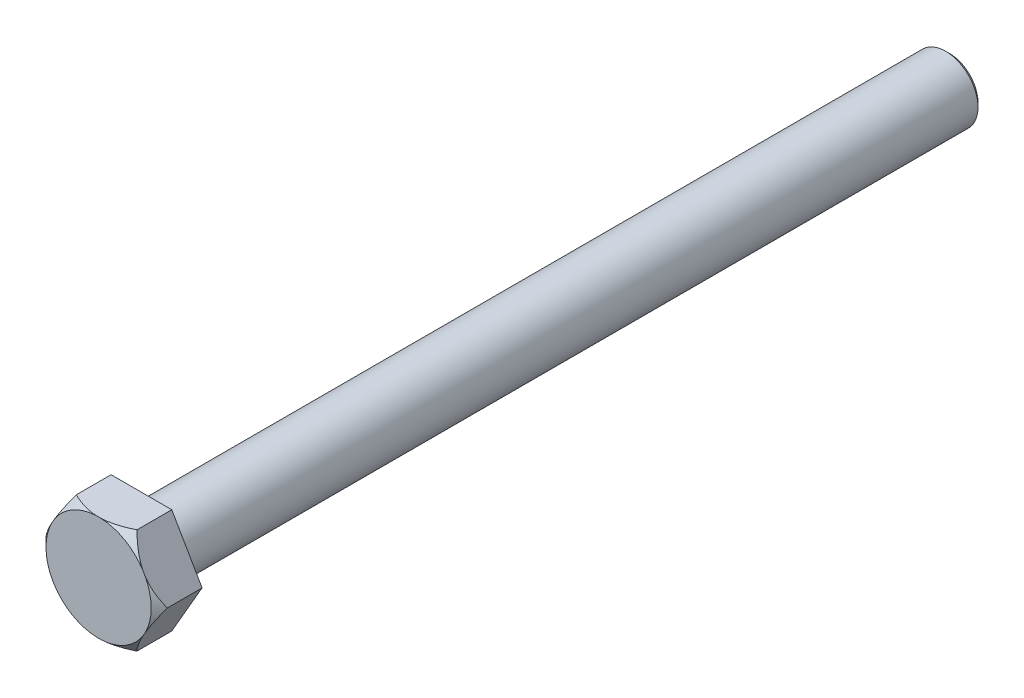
ISO-10303-21;
HEADER;
FILE_DESCRIPTION(('STEP AP214'),'2;1');
FILE_NAME('part.step','',(''),(''),'','','');
FILE_SCHEMA(('AUTOMOTIVE_DESIGN { 1 0 10303 214 1 1 1 1 }'));
ENDSEC;
DATA;
#1=APPLICATION_CONTEXT('core data for automotive mechanical design processes');
#2=APPLICATION_PROTOCOL_DEFINITION('international standard','automotive_design',2000,#1);
#3=PRODUCT_CONTEXT('',#1,'mechanical');
#4=PRODUCT('Part','Part','',(#3));
#5=PRODUCT_RELATED_PRODUCT_CATEGORY('part','',(#4));
#6=PRODUCT_DEFINITION_FORMATION('','',#4);
#7=PRODUCT_DEFINITION_CONTEXT('part definition',#1,'design');
#8=PRODUCT_DEFINITION('design','',#6,#7);
#9=PRODUCT_DEFINITION_SHAPE('','',#8);
#10=(LENGTH_UNIT() NAMED_UNIT(*) SI_UNIT(.MILLI.,.METRE.));
#11=(NAMED_UNIT(*) PLANE_ANGLE_UNIT() SI_UNIT($,.RADIAN.));
#12=(NAMED_UNIT(*) SI_UNIT($,.STERADIAN.) SOLID_ANGLE_UNIT());
#13=UNCERTAINTY_MEASURE_WITH_UNIT(LENGTH_MEASURE(1.E-05),#10,'distance_accuracy_value','');
#14=(GEOMETRIC_REPRESENTATION_CONTEXT(3) GLOBAL_UNCERTAINTY_ASSIGNED_CONTEXT((#13)) GLOBAL_UNIT_ASSIGNED_CONTEXT((#10,
#11,#12)) REPRESENTATION_CONTEXT('',''));
#15=CARTESIAN_POINT('',(0.,0.,0.));
#16=DIRECTION('',(0.,0.,1.));
#17=DIRECTION('',(1.,0.,0.));
#18=AXIS2_PLACEMENT_3D('',#15,#16,#17);
#19=CARTESIAN_POINT('',(0.,-4.,0.));
#20=DIRECTION('',(0.,0.,1.));
#21=DIRECTION('',(1.,0.,0.));
#22=AXIS2_PLACEMENT_3D('',#19,#20,#21);
#23=PLANE('',#22);
#24=CARTESIAN_POINT('',(0.,0.,0.));
#25=DIRECTION('',(0.,0.,1.));
#26=DIRECTION('',(1.,0.,0.));
#27=AXIS2_PLACEMENT_3D('',#24,#25,#26);
#28=CIRCLE('',#27,4.);
#29=CARTESIAN_POINT('',(4.,0.,0.));
#30=VERTEX_POINT('',#29);
#31=EDGE_CURVE('E11',#30,#30,#28,.T.);
#32=ORIENTED_EDGE('',*,*,#31,.T.);
#33=EDGE_LOOP('',(#32));
#34=FACE_BOUND('',#33,.T.);
#35=ADVANCED_FACE('F38',(#34),#23,.T.);
#36=CARTESIAN_POINT('',(0.,0.,0.));
#37=DIRECTION('',(0.,0.,1.));
#38=DIRECTION('',(1.,0.,0.));
#39=AXIS2_PLACEMENT_3D('',#36,#37,#38);
#40=CYLINDRICAL_SURFACE('',#39,4.);
#41=CARTESIAN_POINT('',(0.,0.,-99.5));
#42=DIRECTION('',(0.,0.,1.));
#43=DIRECTION('',(1.,0.,0.));
#44=AXIS2_PLACEMENT_3D('',#41,#42,#43);
#45=CIRCLE('',#44,4.);
#46=CARTESIAN_POINT('',(4.,0.,-99.5));
#47=VERTEX_POINT('',#46);
#48=EDGE_CURVE('E44',#47,#47,#45,.T.);
#49=ORIENTED_EDGE('',*,*,#48,.T.);
#50=EDGE_LOOP('',(#49));
#51=FACE_BOUND('',#50,.T.);
#52=ORIENTED_EDGE('',*,*,#31,.F.);
#53=EDGE_LOOP('',(#52));
#54=FACE_BOUND('',#53,.T.);
#55=ADVANCED_FACE('F64',(#51,#54),#40,.T.);
#56=CARTESIAN_POINT('',(0.,0.,-99.5));
#57=DIRECTION('',(0.,0.,1.));
#58=DIRECTION('',(1.,0.,0.));
#59=AXIS2_PLACEMENT_3D('',#56,#57,#58);
#60=CONICAL_SURFACE('',#59,4.,0.785398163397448);
#61=CARTESIAN_POINT('',(0.,0.,-100.));
#62=DIRECTION('',(0.,0.,1.));
#63=DIRECTION('',(1.,0.,0.));
#64=AXIS2_PLACEMENT_3D('',#61,#62,#63);
#65=CIRCLE('',#64,3.5);
#66=CARTESIAN_POINT('',(3.5,0.,-100.));
#67=VERTEX_POINT('',#66);
#68=EDGE_CURVE('E48',#67,#67,#65,.T.);
#69=ORIENTED_EDGE('',*,*,#68,.T.);
#70=EDGE_LOOP('',(#69));
#71=FACE_BOUND('',#70,.T.);
#72=ORIENTED_EDGE('',*,*,#48,.F.);
#73=EDGE_LOOP('',(#72));
#74=FACE_BOUND('',#73,.T.);
#75=ADVANCED_FACE('F55',(#71,#74),#60,.T.);
#76=CARTESIAN_POINT('',(0.,-3.5,-100.));
#77=DIRECTION('',(0.,0.,-1.));
#78=DIRECTION('',(-1.,0.,0.));
#79=AXIS2_PLACEMENT_3D('',#76,#77,#78);
#80=PLANE('',#79);
#81=ORIENTED_EDGE('',*,*,#68,.F.);
#82=EDGE_LOOP('',(#81));
#83=FACE_BOUND('',#82,.T.);
#84=ADVANCED_FACE('F58',(#83),#80,.T.);
#85=CLOSED_SHELL('',(#35,#55,#75,#84));
#86=MANIFOLD_SOLID_BREP('B2',#85);
#87=CARTESIAN_POINT('',(3.75277674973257,-6.5,5.3));
#88=DIRECTION('',(-0.866025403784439,0.5,0.));
#89=DIRECTION('',(-0.5,-0.866025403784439,0.));
#90=AXIS2_PLACEMENT_3D('',#87,#88,#89);
#91=PLANE('',#90);
#92=DIRECTION('',(0.,0.,-1.));
#93=VECTOR('',#92,1.);
#94=CARTESIAN_POINT('',(7.50555349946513,0.,5.3));
#95=LINE('',#94,#93);
#96=CARTESIAN_POINT('',(7.50555349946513,0.,4.3));
#97=VERTEX_POINT('',#96);
#98=CARTESIAN_POINT('',(7.50555349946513,0.,0.));
#99=VERTEX_POINT('',#98);
#100=EDGE_CURVE('E240',#97,#99,#95,.T.);
#101=ORIENTED_EDGE('',*,*,#100,.F.);
#102=CARTESIAN_POINT('',(10.1286443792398,4.54332667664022,0.704596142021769));
#103=CARTESIAN_POINT('',(10.039761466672,4.38937695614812,0.848684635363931));
#104=CARTESIAN_POINT('',(9.95052655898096,4.23481756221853,0.991912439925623));
#105=CARTESIAN_POINT('',(9.77123095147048,3.92426846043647,1.27631743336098));
#106=CARTESIAN_POINT('',(9.68117017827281,3.76827862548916,1.41749443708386));
#107=CARTESIAN_POINT('',(9.49990390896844,3.45431623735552,1.69777201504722));
#108=CARTESIAN_POINT('',(9.40869621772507,3.29633988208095,1.83686692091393));
#109=CARTESIAN_POINT('',(9.2252068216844,2.97852692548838,2.11218789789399));
#110=CARTESIAN_POINT('',(9.13292514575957,2.81869037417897,2.24841404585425));
#111=CARTESIAN_POINT('',(8.94456358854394,2.49243858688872,2.52115169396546));
#112=CARTESIAN_POINT('',(8.84844908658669,2.32596338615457,2.65756778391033));
#113=CARTESIAN_POINT('',(8.65470525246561,1.99038922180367,2.92602381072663));
#114=CARTESIAN_POINT('',(8.5570759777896,1.82129035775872,3.0580639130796));
#115=CARTESIAN_POINT('',(8.36013893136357,1.48018538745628,3.31668899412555));
#116=CARTESIAN_POINT('',(8.26083264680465,1.30818185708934,3.44327848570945));
#117=CARTESIAN_POINT('',(8.0601982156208,0.960672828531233,3.68985078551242));
#118=CARTESIAN_POINT('',(7.95887032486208,0.78516777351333,3.80983442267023));
#119=CARTESIAN_POINT('',(7.75111491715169,0.425324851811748,4.04472132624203));
#120=CARTESIAN_POINT('',(7.64462356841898,0.24087642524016,4.15940026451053));
#121=CARTESIAN_POINT('',(7.42883796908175,-0.132875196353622,4.37785828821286));
#122=CARTESIAN_POINT('',(7.31954332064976,-0.3221790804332,4.48163581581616));
#123=CARTESIAN_POINT('',(7.09850568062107,-0.705027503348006,4.67487713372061));
#124=CARTESIAN_POINT('',(6.98677906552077,-0.898543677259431,4.7644150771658));
#125=CARTESIAN_POINT('',(6.76025349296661,-1.29089747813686,4.92639894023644));
#126=CARTESIAN_POINT('',(6.64545547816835,-1.48973347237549,4.99885003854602));
#127=CARTESIAN_POINT('',(6.43587432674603,-1.85273867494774,5.11072478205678));
#128=CARTESIAN_POINT('',(6.34158660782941,-2.01604979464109,5.15384004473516));
#129=CARTESIAN_POINT('',(6.15157362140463,-2.34516194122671,5.22476075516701));
#130=CARTESIAN_POINT('',(6.0558485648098,-2.51096260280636,5.25256842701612));
#131=CARTESIAN_POINT('',(5.8637126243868,-2.84375181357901,5.29144611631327));
#132=CARTESIAN_POINT('',(5.76730326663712,-3.01073771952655,5.30254587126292));
#133=CARTESIAN_POINT('',(5.5743709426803,-3.34490630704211,5.30749252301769));
#134=CARTESIAN_POINT('',(5.47784797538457,-3.51208899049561,5.30133925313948));
#135=CARTESIAN_POINT('',(5.28569658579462,-3.84490496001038,5.27215863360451));
#136=CARTESIAN_POINT('',(5.19006652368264,-4.01054108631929,5.24917378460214));
#137=CARTESIAN_POINT('',(5.00008490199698,-4.33959890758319,5.18756324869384));
#138=CARTESIAN_POINT('',(4.90573344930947,-4.50302041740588,5.14893626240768));
#139=CARTESIAN_POINT('',(4.71846263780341,-4.82738297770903,5.05763503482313));
#140=CARTESIAN_POINT('',(4.6255484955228,-4.98831499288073,5.00491850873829));
#141=CARTESIAN_POINT('',(4.44167070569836,-5.30680066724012,4.88744691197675));
#142=CARTESIAN_POINT('',(4.35070696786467,-5.46435448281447,4.82269239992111));
#143=CARTESIAN_POINT('',(4.13900239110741,-5.83103756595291,4.65838995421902));
#144=CARTESIAN_POINT('',(4.01908237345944,-6.03874512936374,4.55462806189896));
#145=CARTESIAN_POINT('',(3.78262258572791,-6.4483054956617,4.33258564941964));
#146=CARTESIAN_POINT('',(3.66608473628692,-6.65015497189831,4.21429707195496));
#147=CARTESIAN_POINT('',(3.43582542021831,-7.0489758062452,3.96621331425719));
#148=CARTESIAN_POINT('',(3.3221102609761,-7.2459362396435,3.83639489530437));
#149=CARTESIAN_POINT('',(3.09735084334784,-7.63523097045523,3.56796602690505));
#150=CARTESIAN_POINT('',(2.98630610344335,-7.82756610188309,3.4293571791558));
#151=CARTESIAN_POINT('',(2.76596059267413,-8.20921572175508,3.14452754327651));
#152=CARTESIAN_POINT('',(2.65667036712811,-8.39851194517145,2.99827427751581));
#153=CARTESIAN_POINT('',(2.44001623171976,-8.77376791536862,2.70017211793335));
#154=CARTESIAN_POINT('',(2.33265239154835,-8.95972754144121,2.54832302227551));
#155=CARTESIAN_POINT('',(2.11967159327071,-9.32862110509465,2.24027391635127));
#156=CARTESIAN_POINT('',(2.01405293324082,-9.51155799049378,2.08407859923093));
#157=CARTESIAN_POINT('',(1.80420589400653,-9.87502372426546,1.76801397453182));
#158=CARTESIAN_POINT('',(1.69997748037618,-10.0555526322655,1.60814475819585));
#159=CARTESIAN_POINT('',(1.51776278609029,-10.3711577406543,1.32438976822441));
#160=CARTESIAN_POINT('',(1.43952456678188,-10.5066703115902,1.20114938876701));
#161=CARTESIAN_POINT('',(1.28399947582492,-10.7760476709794,0.953684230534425));
#162=CARTESIAN_POINT('',(1.20670993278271,-10.9099170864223,0.829466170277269));
#163=CARTESIAN_POINT('',(1.12968586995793,-11.0433266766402,0.704596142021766));
#164=B_SPLINE_CURVE_WITH_KNOTS('',3,(#102,#103,#104,#105,#106,#107,#108,#109,#110,#111,#112,
#113,#114,#115,#116,#117,#118,#119,#120,#121,#122,#123,#124,#125,#126,#127,#128,#129,#130,#131,
#132,#133,#134,#135,#136,#137,#138,#139,#140,#141,#142,#143,#144,#145,#146,#147,#148,#149,#150,
#151,#152,#153,#154,#155,#156,#157,#158,#159,#160,#161,#162,#163),.UNSPECIFIED.,.F.,.F.,(4,2,2,
2,2,2,2,2,2,2,2,2,2,2,2,2,2,2,2,2,2,2,2,2,2,2,2,2,2,2,4),(0.,0.686488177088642,1.3730379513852,
2.06120340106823,2.749350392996,3.4564439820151,4.16351080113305,4.8699804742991,
5.57636129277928,6.30179544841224,7.02733312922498,7.74895922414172,8.47036632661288,
9.05013970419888,9.62982882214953,10.2084849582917,10.7871466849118,11.3643522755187,
11.941605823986,12.52061163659,13.0995905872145,13.8829026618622,14.6666511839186,
15.4520168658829,16.2372398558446,17.0261239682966,17.8150365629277,18.6031280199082,
19.3911999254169,19.9887336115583,20.5836377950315),.UNSPECIFIED.);
#165=CARTESIAN_POINT('',(5.76353991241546,-3.01725604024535,5.3));
#166=VERTEX_POINT('',#165);
#167=EDGE_CURVE('E218',#97,#166,#164,.T.);
#168=ORIENTED_EDGE('',*,*,#167,.T.);
#169=DIRECTION('',(0.5,0.866025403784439,0.));
#170=VECTOR('',#169,1.);
#171=CARTESIAN_POINT('',(3.75277674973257,-6.5,5.3));
#172=LINE('',#171,#170);
#173=CARTESIAN_POINT('',(5.49479033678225,-3.48274395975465,5.3));
#174=VERTEX_POINT('',#173);
#175=EDGE_CURVE('E232',#174,#166,#172,.T.);
#176=ORIENTED_EDGE('',*,*,#175,.F.);
#177=CARTESIAN_POINT('',(3.75277674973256,-6.5,4.3));
#178=VERTEX_POINT('',#177);
#179=EDGE_CURVE('E305',#174,#178,#164,.T.);
#180=ORIENTED_EDGE('',*,*,#179,.T.);
#181=DIRECTION('',(0.,0.,-1.));
#182=VECTOR('',#181,1.);
#183=CARTESIAN_POINT('',(3.75277674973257,-6.5,5.3));
#184=LINE('',#183,#182);
#185=CARTESIAN_POINT('',(3.75277674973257,-6.5,0.));
#186=VERTEX_POINT('',#185);
#187=EDGE_CURVE('E213',#178,#186,#184,.T.);
#188=ORIENTED_EDGE('',*,*,#187,.T.);
#189=DIRECTION('',(0.5,0.866025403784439,0.));
#190=VECTOR('',#189,1.);
#191=CARTESIAN_POINT('',(3.75277674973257,-6.5,0.));
#192=LINE('',#191,#190);
#193=EDGE_CURVE('E214',#186,#99,#192,.T.);
#194=ORIENTED_EDGE('',*,*,#193,.T.);
#195=EDGE_LOOP('',(#101,#168,#176,#180,#188,#194));
#196=FACE_BOUND('',#195,.T.);
#197=ADVANCED_FACE('F93',(#196),#91,.F.);
#198=CARTESIAN_POINT('',(7.50555349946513,0.,5.3));
#199=DIRECTION('',(-0.866025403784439,-0.5,0.));
#200=DIRECTION('',(0.5,-0.866025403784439,0.));
#201=AXIS2_PLACEMENT_3D('',#198,#199,#200);
#202=PLANE('',#201);
#203=DIRECTION('',(0.,0.,-1.));
#204=VECTOR('',#203,1.);
#205=CARTESIAN_POINT('',(3.75277674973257,6.5,5.3));
#206=LINE('',#205,#204);
#207=CARTESIAN_POINT('',(3.75277674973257,6.5,4.3));
#208=VERTEX_POINT('',#207);
#209=CARTESIAN_POINT('',(3.75277674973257,6.5,0.));
#210=VERTEX_POINT('',#209);
#211=EDGE_CURVE('E239',#208,#210,#206,.T.);
#212=ORIENTED_EDGE('',*,*,#211,.F.);
#213=CARTESIAN_POINT('',(1.12968586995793,11.0433266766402,0.704596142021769));
#214=CARTESIAN_POINT('',(1.21856878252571,10.8893769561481,0.848684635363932));
#215=CARTESIAN_POINT('',(1.30780369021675,10.7348175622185,0.991912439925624));
#216=CARTESIAN_POINT('',(1.48709929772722,10.4242684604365,1.27631743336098));
#217=CARTESIAN_POINT('',(1.57716007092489,10.2682786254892,1.41749443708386));
#218=CARTESIAN_POINT('',(1.75842634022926,9.95431623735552,1.69777201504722));
#219=CARTESIAN_POINT('',(1.84963403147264,9.79633988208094,1.83686692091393));
#220=CARTESIAN_POINT('',(2.0331234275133,9.47852692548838,2.11218789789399));
#221=CARTESIAN_POINT('',(2.12540510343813,9.31869037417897,2.24841404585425));
#222=CARTESIAN_POINT('',(2.31376666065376,8.99243858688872,2.52115169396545));
#223=CARTESIAN_POINT('',(2.40988116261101,8.82596338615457,2.65756778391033));
#224=CARTESIAN_POINT('',(2.60362499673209,8.49038922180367,2.92602381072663));
#225=CARTESIAN_POINT('',(2.7012542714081,8.32129035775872,3.05806391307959));
#226=CARTESIAN_POINT('',(2.89819131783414,7.98018538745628,3.31668899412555));
#227=CARTESIAN_POINT('',(2.99749760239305,7.80818185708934,3.44327848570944));
#228=CARTESIAN_POINT('',(3.1981320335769,7.46067282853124,3.68985078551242));
#229=CARTESIAN_POINT('',(3.29945992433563,7.28516777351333,3.80983442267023));
#230=CARTESIAN_POINT('',(3.50721533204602,6.92532485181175,4.04472132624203));
#231=CARTESIAN_POINT('',(3.61370668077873,6.74087642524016,4.15940026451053));
#232=CARTESIAN_POINT('',(3.82949228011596,6.36712480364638,4.37785828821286));
#233=CARTESIAN_POINT('',(3.93878692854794,6.1778209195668,4.48163581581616));
#234=CARTESIAN_POINT('',(4.15982456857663,5.794972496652,4.67487713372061));
#235=CARTESIAN_POINT('',(4.27155118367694,5.60145632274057,4.7644150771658));
#236=CARTESIAN_POINT('',(4.49807675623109,5.20910252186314,4.92639894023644));
#237=CARTESIAN_POINT('',(4.61287477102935,5.01026652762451,4.99885003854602));
#238=CARTESIAN_POINT('',(4.82245592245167,4.64726132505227,5.11072478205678));
#239=CARTESIAN_POINT('',(4.91674364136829,4.48395020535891,5.15384004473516));
#240=CARTESIAN_POINT('',(5.10675662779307,4.15483805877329,5.22476075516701));
#241=CARTESIAN_POINT('',(5.20248168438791,3.98903739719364,5.25256842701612));
#242=CARTESIAN_POINT('',(5.3946176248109,3.65624818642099,5.29144611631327));
#243=CARTESIAN_POINT('',(5.49102698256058,3.48926228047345,5.30254587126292));
#244=CARTESIAN_POINT('',(5.6839593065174,3.15509369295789,5.30749252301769));
#245=CARTESIAN_POINT('',(5.78048227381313,2.98791100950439,5.30133925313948));
#246=CARTESIAN_POINT('',(5.97263366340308,2.65509503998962,5.27215863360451));
#247=CARTESIAN_POINT('',(6.06826372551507,2.48945891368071,5.24917378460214));
#248=CARTESIAN_POINT('',(6.25824534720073,2.16040109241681,5.18756324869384));
#249=CARTESIAN_POINT('',(6.35259679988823,1.99697958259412,5.14893626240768));
#250=CARTESIAN_POINT('',(6.5398676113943,1.67261702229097,5.05763503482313));
#251=CARTESIAN_POINT('',(6.6327817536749,1.51168500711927,5.00491850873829));
#252=CARTESIAN_POINT('',(6.81665954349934,1.19319933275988,4.88744691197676));
#253=CARTESIAN_POINT('',(6.90762328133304,1.03564551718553,4.82269239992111));
#254=CARTESIAN_POINT('',(7.1193278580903,0.668962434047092,4.65838995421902));
#255=CARTESIAN_POINT('',(7.23924787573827,0.461254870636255,4.55462806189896));
#256=CARTESIAN_POINT('',(7.4757076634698,0.0516945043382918,4.33258564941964));
#257=CARTESIAN_POINT('',(7.59224551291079,-0.150154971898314,4.21429707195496));
#258=CARTESIAN_POINT('',(7.82250482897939,-0.548975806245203,3.96621331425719));
#259=CARTESIAN_POINT('',(7.93621998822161,-0.7459362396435,3.83639489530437));
#260=CARTESIAN_POINT('',(8.16097940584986,-1.13523097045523,3.56796602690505));
#261=CARTESIAN_POINT('',(8.27202414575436,-1.32756610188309,3.4293571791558));
#262=CARTESIAN_POINT('',(8.49236965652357,-1.70921572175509,3.14452754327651));
#263=CARTESIAN_POINT('',(8.6016598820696,-1.89851194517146,2.99827427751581));
#264=CARTESIAN_POINT('',(8.81831401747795,-2.27376791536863,2.70017211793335));
#265=CARTESIAN_POINT('',(8.92567785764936,-2.45972754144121,2.5483230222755));
#266=CARTESIAN_POINT('',(9.138658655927,-2.82862110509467,2.24027391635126));
#267=CARTESIAN_POINT('',(9.24427731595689,-3.01155799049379,2.08407859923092));
#268=CARTESIAN_POINT('',(9.45412435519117,-3.37502372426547,1.76801397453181));
#269=CARTESIAN_POINT('',(9.55835276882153,-3.55555263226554,1.60814475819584));
#270=CARTESIAN_POINT('',(9.74056746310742,-3.87115774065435,1.3243897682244));
#271=CARTESIAN_POINT('',(9.81880568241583,-4.00667031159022,1.20114938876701));
#272=CARTESIAN_POINT('',(9.97433077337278,-4.27604767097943,0.953684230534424));
#273=CARTESIAN_POINT('',(10.051620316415,-4.40991708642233,0.829466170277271));
#274=CARTESIAN_POINT('',(10.1286443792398,-4.54332667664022,0.704596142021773));
#275=B_SPLINE_CURVE_WITH_KNOTS('',3,(#213,#214,#215,#216,#217,#218,#219,#220,#221,#222,#223,
#224,#225,#226,#227,#228,#229,#230,#231,#232,#233,#234,#235,#236,#237,#238,#239,#240,#241,#242,
#243,#244,#245,#246,#247,#248,#249,#250,#251,#252,#253,#254,#255,#256,#257,#258,#259,#260,#261,
#262,#263,#264,#265,#266,#267,#268,#269,#270,#271,#272,#273,#274),.UNSPECIFIED.,.F.,.F.,(4,2,2,
2,2,2,2,2,2,2,2,2,2,2,2,2,2,2,2,2,2,2,2,2,2,2,2,2,2,2,4),(0.,0.686488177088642,1.37303795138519,
2.06120340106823,2.749350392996,3.4564439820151,4.16351080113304,4.86998047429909,
5.57636129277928,6.30179544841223,7.02733312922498,7.74895922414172,8.47036632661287,
9.05013970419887,9.62982882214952,10.2084849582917,10.7871466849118,11.3643522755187,
11.941605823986,12.52061163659,13.0995905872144,13.8829026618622,14.6666511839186,
15.4520168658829,16.2372398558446,17.0261239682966,17.8150365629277,18.6031280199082,
19.391199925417,19.9887336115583,20.5836377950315),.UNSPECIFIED.);
#276=CARTESIAN_POINT('',(5.49479033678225,3.48274395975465,5.3));
#277=VERTEX_POINT('',#276);
#278=EDGE_CURVE('E268',#208,#277,#275,.T.);
#279=ORIENTED_EDGE('',*,*,#278,.T.);
#280=DIRECTION('',(-0.5,0.866025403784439,0.));
#281=VECTOR('',#280,1.);
#282=CARTESIAN_POINT('',(7.50555349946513,0.,5.3));
#283=LINE('',#282,#281);
#284=CARTESIAN_POINT('',(5.76353991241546,3.01725604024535,5.3));
#285=VERTEX_POINT('',#284);
#286=EDGE_CURVE('E207',#285,#277,#283,.T.);
#287=ORIENTED_EDGE('',*,*,#286,.F.);
#288=EDGE_CURVE('E273',#285,#97,#275,.T.);
#289=ORIENTED_EDGE('',*,*,#288,.T.);
#290=ORIENTED_EDGE('',*,*,#100,.T.);
#291=DIRECTION('',(-0.5,0.866025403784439,0.));
#292=VECTOR('',#291,1.);
#293=CARTESIAN_POINT('',(7.50555349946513,0.,0.));
#294=LINE('',#293,#292);
#295=EDGE_CURVE('E217',#99,#210,#294,.T.);
#296=ORIENTED_EDGE('',*,*,#295,.T.);
#297=EDGE_LOOP('',(#212,#279,#287,#289,#290,#296));
#298=FACE_BOUND('',#297,.T.);
#299=ADVANCED_FACE('F278',(#298),#202,.F.);
#300=CARTESIAN_POINT('',(3.75277674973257,6.5,5.3));
#301=DIRECTION('',(0.,-1.,0.));
#302=DIRECTION('',(1.,0.,0.));
#303=AXIS2_PLACEMENT_3D('',#300,#301,#302);
#304=PLANE('',#303);
#305=DIRECTION('',(0.,0.,-1.));
#306=VECTOR('',#305,1.);
#307=CARTESIAN_POINT('',(-3.75277674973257,6.5,5.3));
#308=LINE('',#307,#306);
#309=CARTESIAN_POINT('',(-3.75277674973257,6.5,4.3));
#310=VERTEX_POINT('',#309);
#311=CARTESIAN_POINT('',(-3.75277674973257,6.5,0.));
#312=VERTEX_POINT('',#311);
#313=EDGE_CURVE('E237',#310,#312,#308,.T.);
#314=ORIENTED_EDGE('',*,*,#313,.F.);
#315=CARTESIAN_POINT('',(-8.29610342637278,6.5,1.26632525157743));
#316=CARTESIAN_POINT('',(-8.11036530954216,6.5,1.41250581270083));
#317=CARTESIAN_POINT('',(-7.92373684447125,6.5,1.55756954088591));
#318=CARTESIAN_POINT('',(-7.54835509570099,6.5,1.84498409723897));
#319=CARTESIAN_POINT('',(-7.35960146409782,6.5,1.98733447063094));
#320=CARTESIAN_POINT('',(-6.97873252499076,6.5,2.2695011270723));
#321=CARTESIAN_POINT('',(-6.7866050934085,6.5,2.40930108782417));
#322=CARTESIAN_POINT('',(-6.39953728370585,6.5,2.68493925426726));
#323=CARTESIAN_POINT('',(-6.20459704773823,6.5,2.82077765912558));
#324=CARTESIAN_POINT('',(-5.80175036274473,6.5,3.09421885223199));
#325=CARTESIAN_POINT('',(-5.59367836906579,6.5,3.231578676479));
#326=CARTESIAN_POINT('',(-5.17329124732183,6.5,3.49972871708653));
#327=CARTESIAN_POINT('',(-4.96097565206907,6.5,3.63051820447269));
#328=CARTESIAN_POINT('',(-4.53185755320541,6.5,3.88357409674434));
#329=CARTESIAN_POINT('',(-4.31506466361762,6.5,4.00585671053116));
#330=CARTESIAN_POINT('',(-3.87593140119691,6.5,4.23995118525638));
#331=CARTESIAN_POINT('',(-3.65359273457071,6.5,4.35176621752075));
#332=CARTESIAN_POINT('',(-3.22593082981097,6.5,4.55126761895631));
#333=CARTESIAN_POINT('',(-3.02121813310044,6.5,4.64025315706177));
#334=CARTESIAN_POINT('',(-2.60646306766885,6.5,4.80502186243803));
#335=CARTESIAN_POINT('',(-2.39642019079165,6.5,4.88080376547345));
#336=CARTESIAN_POINT('',(-1.97356357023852,6.5,5.01546630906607));
#337=CARTESIAN_POINT('',(-1.76080909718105,6.5,5.07453054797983));
#338=CARTESIAN_POINT('',(-1.33093571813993,6.5,5.17398366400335));
#339=CARTESIAN_POINT('',(-1.11381737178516,6.5,5.21437492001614));
#340=CARTESIAN_POINT('',(-0.672554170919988,6.5,5.27457108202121));
#341=CARTESIAN_POINT('',(-0.448353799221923,6.5,5.29397782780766));
#342=CARTESIAN_POINT('',(0.000845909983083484,6.5,5.30942901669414));
#343=CARTESIAN_POINT('',(0.225845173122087,6.5,5.30547558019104));
#344=CARTESIAN_POINT('',(0.67488777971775,6.5,5.27446419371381));
#345=CARTESIAN_POINT('',(0.898926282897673,6.5,5.24733749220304));
#346=CARTESIAN_POINT('',(1.34336613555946,6.5,5.17180698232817));
#347=CARTESIAN_POINT('',(1.56376649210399,6.5,5.12339746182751));
#348=CARTESIAN_POINT('',(2.06628953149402,6.5,4.99055568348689));
#349=CARTESIAN_POINT('',(2.34668289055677,6.5,4.89963518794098));
#350=CARTESIAN_POINT('',(2.89824997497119,6.5,4.69329359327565));
#351=CARTESIAN_POINT('',(3.16941809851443,6.5,4.57785790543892));
#352=CARTESIAN_POINT('',(3.70495151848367,6.5,4.32757146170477));
#353=CARTESIAN_POINT('',(3.96925216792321,6.5,4.19258424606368));
#354=CARTESIAN_POINT('',(4.49001736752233,6.5,3.90855044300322));
#355=CARTESIAN_POINT('',(4.74648371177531,6.5,3.75950710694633));
#356=CARTESIAN_POINT('',(5.2907154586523,6.5,3.42770091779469));
#357=CARTESIAN_POINT('',(5.57743102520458,6.5,3.24322742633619));
#358=CARTESIAN_POINT('',(6.14392762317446,6.5,2.86387292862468));
#359=CARTESIAN_POINT('',(6.42370706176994,6.5,2.66898956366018));
#360=CARTESIAN_POINT('',(6.97140928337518,6.5,2.27586119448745));
#361=CARTESIAN_POINT('',(7.23945723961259,6.5,2.07778986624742));
#362=CARTESIAN_POINT('',(7.63813759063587,6.5,1.77641508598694));
#363=CARTESIAN_POINT('',(7.77042024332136,6.5,1.67528153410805));
#364=CARTESIAN_POINT('',(8.0339850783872,6.5,1.47172940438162));
#365=CARTESIAN_POINT('',(8.16526730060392,6.5,1.36931087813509));
#366=CARTESIAN_POINT('',(8.29610342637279,6.5,1.26632525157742));
#367=B_SPLINE_CURVE_WITH_KNOTS('',3,(#315,#316,#317,#318,#319,#320,#321,#322,#323,#324,#325,
#326,#327,#328,#329,#330,#331,#332,#333,#334,#335,#336,#337,#338,#339,#340,#341,#342,#343,#344,
#345,#346,#347,#348,#349,#350,#351,#352,#353,#354,#355,#356,#357,#358,#359,#360,#361,#362,#363,
#364,#365,#366),.UNSPECIFIED.,.F.,.F.,(4,2,2,2,2,2,2,2,2,2,2,2,2,2,2,2,2,2,2,2,2,2,2,2,2,4),(0.,
0.709097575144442,1.41831297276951,2.13109111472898,2.84383335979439,3.59170118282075,
4.3396517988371,5.0861358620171,5.83239302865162,6.5016733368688,7.17101769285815,
7.83269743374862,8.49429285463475,9.16823229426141,9.84211056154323,10.5179950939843,
11.1940611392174,12.0768086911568,12.9600830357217,13.8498492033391,14.7394100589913,
15.7619006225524,16.7846238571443,17.7843881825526,18.2839221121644,18.7834360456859),.UNSPECIFIED.);
#368=CARTESIAN_POINT('',(-0.26874957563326,6.5,5.3));
#369=VERTEX_POINT('',#368);
#370=EDGE_CURVE('E255',#310,#369,#367,.T.);
#371=ORIENTED_EDGE('',*,*,#370,.T.);
#372=DIRECTION('',(-1.,0.,0.));
#373=VECTOR('',#372,1.);
#374=CARTESIAN_POINT('',(3.75277674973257,6.5,5.3));
#375=LINE('',#374,#373);
#376=CARTESIAN_POINT('',(0.268749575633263,6.5,5.3));
#377=VERTEX_POINT('',#376);
#378=EDGE_CURVE('E203',#377,#369,#375,.T.);
#379=ORIENTED_EDGE('',*,*,#378,.F.);
#380=EDGE_CURVE('E261',#377,#208,#367,.T.);
#381=ORIENTED_EDGE('',*,*,#380,.T.);
#382=ORIENTED_EDGE('',*,*,#211,.T.);
#383=DIRECTION('',(-1.,0.,0.));
#384=VECTOR('',#383,1.);
#385=CARTESIAN_POINT('',(3.75277674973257,6.5,0.));
#386=LINE('',#385,#384);
#387=EDGE_CURVE('E221',#210,#312,#386,.T.);
#388=ORIENTED_EDGE('',*,*,#387,.T.);
#389=EDGE_LOOP('',(#314,#371,#379,#381,#382,#388));
#390=FACE_BOUND('',#389,.T.);
#391=ADVANCED_FACE('F259',(#390),#304,.F.);
#392=CARTESIAN_POINT('',(-3.75277674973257,6.5,5.3));
#393=DIRECTION('',(0.866025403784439,-0.5,0.));
#394=DIRECTION('',(0.5,0.866025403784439,0.));
#395=AXIS2_PLACEMENT_3D('',#392,#393,#394);
#396=PLANE('',#395);
#397=DIRECTION('',(0.,0.,-1.));
#398=VECTOR('',#397,1.);
#399=CARTESIAN_POINT('',(-7.50555349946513,0.,5.3));
#400=LINE('',#399,#398);
#401=CARTESIAN_POINT('',(-7.50555349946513,0.,4.3));
#402=VERTEX_POINT('',#401);
#403=CARTESIAN_POINT('',(-7.50555349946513,0.,0.));
#404=VERTEX_POINT('',#403);
#405=EDGE_CURVE('E195',#402,#404,#400,.T.);
#406=ORIENTED_EDGE('',*,*,#405,.F.);
#407=CARTESIAN_POINT('',(-10.1286443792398,-4.54332667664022,0.704596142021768));
#408=CARTESIAN_POINT('',(-10.039761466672,-4.38937695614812,0.84868463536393));
#409=CARTESIAN_POINT('',(-9.95052655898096,-4.23481756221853,0.991912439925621));
#410=CARTESIAN_POINT('',(-9.77123095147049,-3.92426846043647,1.27631743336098));
#411=CARTESIAN_POINT('',(-9.68117017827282,-3.76827862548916,1.41749443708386));
#412=CARTESIAN_POINT('',(-9.49990390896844,-3.45431623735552,1.69777201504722));
#413=CARTESIAN_POINT('',(-9.40869621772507,-3.29633988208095,1.83686692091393));
#414=CARTESIAN_POINT('',(-9.2252068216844,-2.97852692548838,2.11218789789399));
#415=CARTESIAN_POINT('',(-9.13292514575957,-2.81869037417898,2.24841404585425));
#416=CARTESIAN_POINT('',(-8.94456358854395,-2.49243858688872,2.52115169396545));
#417=CARTESIAN_POINT('',(-8.84844908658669,-2.32596338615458,2.65756778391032));
#418=CARTESIAN_POINT('',(-8.65470525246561,-1.99038922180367,2.92602381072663));
#419=CARTESIAN_POINT('',(-8.55707597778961,-1.82129035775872,3.05806391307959));
#420=CARTESIAN_POINT('',(-8.36013893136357,-1.48018538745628,3.31668899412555));
#421=CARTESIAN_POINT('',(-8.26083264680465,-1.30818185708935,3.44327848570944));
#422=CARTESIAN_POINT('',(-8.0601982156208,-0.96067282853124,3.68985078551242));
#423=CARTESIAN_POINT('',(-7.95887032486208,-0.785167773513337,3.80983442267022));
#424=CARTESIAN_POINT('',(-7.75111491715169,-0.425324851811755,4.04472132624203));
#425=CARTESIAN_POINT('',(-7.64462356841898,-0.240876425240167,4.15940026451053));
#426=CARTESIAN_POINT('',(-7.42883796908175,0.132875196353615,4.37785828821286));
#427=CARTESIAN_POINT('',(-7.31954332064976,0.322179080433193,4.48163581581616));
#428=CARTESIAN_POINT('',(-7.09850568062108,0.705027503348,4.67487713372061));
#429=CARTESIAN_POINT('',(-6.98677906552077,0.898543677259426,4.7644150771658));
#430=CARTESIAN_POINT('',(-6.76025349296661,1.29089747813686,4.92639894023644));
#431=CARTESIAN_POINT('',(-6.64545547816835,1.48973347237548,4.99885003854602));
#432=CARTESIAN_POINT('',(-6.43587432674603,1.85273867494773,5.11072478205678));
#433=CARTESIAN_POINT('',(-6.34158660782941,2.01604979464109,5.15384004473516));
#434=CARTESIAN_POINT('',(-6.15157362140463,2.3451619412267,5.22476075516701));
#435=CARTESIAN_POINT('',(-6.0558485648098,2.51096260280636,5.25256842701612));
#436=CARTESIAN_POINT('',(-5.86371262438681,2.84375181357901,5.29144611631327));
#437=CARTESIAN_POINT('',(-5.76730326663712,3.01073771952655,5.30254587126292));
#438=CARTESIAN_POINT('',(-5.5743709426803,3.3449063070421,5.30749252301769));
#439=CARTESIAN_POINT('',(-5.47784797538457,3.51208899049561,5.30133925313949));
#440=CARTESIAN_POINT('',(-5.28569658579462,3.84490496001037,5.27215863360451));
#441=CARTESIAN_POINT('',(-5.19006652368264,4.01054108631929,5.24917378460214));
#442=CARTESIAN_POINT('',(-5.00008490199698,4.33959890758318,5.18756324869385));
#443=CARTESIAN_POINT('',(-4.90573344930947,4.50302041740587,5.14893626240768));
#444=CARTESIAN_POINT('',(-4.71846263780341,4.82738297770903,5.05763503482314));
#445=CARTESIAN_POINT('',(-4.6255484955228,4.98831499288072,5.00491850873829));
#446=CARTESIAN_POINT('',(-4.44167070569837,5.30680066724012,4.88744691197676));
#447=CARTESIAN_POINT('',(-4.35070696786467,5.46435448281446,4.82269239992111));
#448=CARTESIAN_POINT('',(-4.13900239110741,5.8310375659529,4.65838995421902));
#449=CARTESIAN_POINT('',(-4.01908237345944,6.03874512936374,4.55462806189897));
#450=CARTESIAN_POINT('',(-3.78262258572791,6.4483054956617,4.33258564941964));
#451=CARTESIAN_POINT('',(-3.66608473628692,6.6501549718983,4.21429707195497));
#452=CARTESIAN_POINT('',(-3.43582542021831,7.04897580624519,3.9662133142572));
#453=CARTESIAN_POINT('',(-3.3221102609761,7.24593623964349,3.83639489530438));
#454=CARTESIAN_POINT('',(-3.09735084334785,7.63523097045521,3.56796602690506));
#455=CARTESIAN_POINT('',(-2.98630610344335,7.82756610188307,3.42935717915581));
#456=CARTESIAN_POINT('',(-2.76596059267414,8.20921572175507,3.14452754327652));
#457=CARTESIAN_POINT('',(-2.65667036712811,8.39851194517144,2.99827427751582));
#458=CARTESIAN_POINT('',(-2.44001623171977,8.77376791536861,2.70017211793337));
#459=CARTESIAN_POINT('',(-2.33265239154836,8.95972754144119,2.54832302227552));
#460=CARTESIAN_POINT('',(-2.11967159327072,9.32862110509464,2.24027391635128));
#461=CARTESIAN_POINT('',(-2.01405293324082,9.51155799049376,2.08407859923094));
#462=CARTESIAN_POINT('',(-1.80420589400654,9.87502372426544,1.76801397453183));
#463=CARTESIAN_POINT('',(-1.69997748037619,10.0555526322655,1.60814475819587));
#464=CARTESIAN_POINT('',(-1.51776278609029,10.3711577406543,1.32438976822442));
#465=CARTESIAN_POINT('',(-1.43952456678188,10.5066703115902,1.20114938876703));
#466=CARTESIAN_POINT('',(-1.28399947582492,10.7760476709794,0.953684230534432));
#467=CARTESIAN_POINT('',(-1.20670993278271,10.9099170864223,0.829466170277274));
#468=CARTESIAN_POINT('',(-1.12968586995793,11.0433266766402,0.704596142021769));
#469=B_SPLINE_CURVE_WITH_KNOTS('',3,(#407,#408,#409,#410,#411,#412,#413,#414,#415,#416,#417,
#418,#419,#420,#421,#422,#423,#424,#425,#426,#427,#428,#429,#430,#431,#432,#433,#434,#435,#436,
#437,#438,#439,#440,#441,#442,#443,#444,#445,#446,#447,#448,#449,#450,#451,#452,#453,#454,#455,
#456,#457,#458,#459,#460,#461,#462,#463,#464,#465,#466,#467,#468),.UNSPECIFIED.,.F.,.F.,(4,2,2,
2,2,2,2,2,2,2,2,2,2,2,2,2,2,2,2,2,2,2,2,2,2,2,2,2,2,2,4),(0.,0.686488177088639,1.37303795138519,
2.06120340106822,2.749350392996,3.45644398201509,4.16351080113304,4.86998047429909,
5.57636129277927,6.30179544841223,7.02733312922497,7.74895922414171,8.47036632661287,
9.05013970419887,9.62982882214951,10.2084849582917,10.7871466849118,11.3643522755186,
11.9416058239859,12.52061163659,13.0995905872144,13.8829026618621,14.6666511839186,
15.4520168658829,16.2372398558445,17.0261239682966,17.8150365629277,18.6031280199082,
19.3911999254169,19.9887336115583,20.5836377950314),.UNSPECIFIED.);
#470=CARTESIAN_POINT('',(-5.76353991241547,3.01725604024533,5.3));
#471=VERTEX_POINT('',#470);
#472=EDGE_CURVE('E182',#402,#471,#469,.T.);
#473=ORIENTED_EDGE('',*,*,#472,.T.);
#474=DIRECTION('',(-0.5,-0.866025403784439,0.));
#475=VECTOR('',#474,1.);
#476=CARTESIAN_POINT('',(-3.75277674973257,6.5,5.3));
#477=LINE('',#476,#475);
#478=CARTESIAN_POINT('',(-5.49479033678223,3.48274395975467,5.3));
#479=VERTEX_POINT('',#478);
#480=EDGE_CURVE('E193',#479,#471,#477,.T.);
#481=ORIENTED_EDGE('',*,*,#480,.F.);
#482=EDGE_CURVE('E196',#479,#310,#469,.T.);
#483=ORIENTED_EDGE('',*,*,#482,.T.);
#484=ORIENTED_EDGE('',*,*,#313,.T.);
#485=DIRECTION('',(-0.5,-0.866025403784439,0.));
#486=VECTOR('',#485,1.);
#487=CARTESIAN_POINT('',(-3.75277674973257,6.5,0.));
#488=LINE('',#487,#486);
#489=EDGE_CURVE('E224',#312,#404,#488,.T.);
#490=ORIENTED_EDGE('',*,*,#489,.T.);
#491=EDGE_LOOP('',(#406,#473,#481,#483,#484,#490));
#492=FACE_BOUND('',#491,.T.);
#493=ADVANCED_FACE('F191',(#492),#396,.F.);
#494=CARTESIAN_POINT('',(-7.50555349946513,0.,5.3));
#495=DIRECTION('',(0.866025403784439,0.5,0.));
#496=DIRECTION('',(-0.5,0.866025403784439,0.));
#497=AXIS2_PLACEMENT_3D('',#494,#495,#496);
#498=PLANE('',#497);
#499=DIRECTION('',(0.,0.,-1.));
#500=VECTOR('',#499,1.);
#501=CARTESIAN_POINT('',(-3.75277674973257,-6.5,5.3));
#502=LINE('',#501,#500);
#503=CARTESIAN_POINT('',(-3.75277674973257,-6.5,4.3));
#504=VERTEX_POINT('',#503);
#505=CARTESIAN_POINT('',(-3.75277674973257,-6.5,0.));
#506=VERTEX_POINT('',#505);
#507=EDGE_CURVE('E234',#504,#506,#502,.T.);
#508=ORIENTED_EDGE('',*,*,#507,.F.);
#509=CARTESIAN_POINT('',(-1.12968586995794,-11.0433266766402,0.70459614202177));
#510=CARTESIAN_POINT('',(-1.21856878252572,-10.8893769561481,0.848684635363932));
#511=CARTESIAN_POINT('',(-1.30780369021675,-10.7348175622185,0.991912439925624));
#512=CARTESIAN_POINT('',(-1.48709929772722,-10.4242684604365,1.27631743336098));
#513=CARTESIAN_POINT('',(-1.57716007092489,-10.2682786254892,1.41749443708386));
#514=CARTESIAN_POINT('',(-1.75842634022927,-9.95431623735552,1.69777201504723));
#515=CARTESIAN_POINT('',(-1.84963403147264,-9.79633988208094,1.83686692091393));
#516=CARTESIAN_POINT('',(-2.03312342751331,-9.47852692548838,2.11218789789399));
#517=CARTESIAN_POINT('',(-2.12540510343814,-9.31869037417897,2.24841404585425));
#518=CARTESIAN_POINT('',(-2.31376666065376,-8.99243858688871,2.52115169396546));
#519=CARTESIAN_POINT('',(-2.40988116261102,-8.82596338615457,2.65756778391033));
#520=CARTESIAN_POINT('',(-2.6036249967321,-8.49038922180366,2.92602381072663));
#521=CARTESIAN_POINT('',(-2.70125427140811,-8.32129035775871,3.0580639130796));
#522=CARTESIAN_POINT('',(-2.89819131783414,-7.98018538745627,3.31668899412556));
#523=CARTESIAN_POINT('',(-2.99749760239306,-7.80818185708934,3.44327848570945));
#524=CARTESIAN_POINT('',(-3.19813203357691,-7.46067282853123,3.68985078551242));
#525=CARTESIAN_POINT('',(-3.29945992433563,-7.28516777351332,3.80983442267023));
#526=CARTESIAN_POINT('',(-3.50721533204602,-6.92532485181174,4.04472132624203));
#527=CARTESIAN_POINT('',(-3.61370668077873,-6.74087642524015,4.15940026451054));
#528=CARTESIAN_POINT('',(-3.82949228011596,-6.36712480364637,4.37785828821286));
#529=CARTESIAN_POINT('',(-3.93878692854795,-6.17782091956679,4.48163581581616));
#530=CARTESIAN_POINT('',(-4.15982456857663,-5.79497249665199,4.67487713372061));
#531=CARTESIAN_POINT('',(-4.27155118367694,-5.60145632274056,4.7644150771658));
#532=CARTESIAN_POINT('',(-4.4980767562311,-5.20910252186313,4.92639894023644));
#533=CARTESIAN_POINT('',(-4.61287477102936,-5.0102665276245,4.99885003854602));
#534=CARTESIAN_POINT('',(-4.82245592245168,-4.64726132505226,5.11072478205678));
#535=CARTESIAN_POINT('',(-4.9167436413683,-4.4839502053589,5.15384004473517));
#536=CARTESIAN_POINT('',(-5.10675662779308,-4.15483805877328,5.22476075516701));
#537=CARTESIAN_POINT('',(-5.20248168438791,-3.98903739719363,5.25256842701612));
#538=CARTESIAN_POINT('',(-5.3946176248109,-3.65624818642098,5.29144611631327));
#539=CARTESIAN_POINT('',(-5.49102698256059,-3.48926228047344,5.30254587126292));
#540=CARTESIAN_POINT('',(-5.68395930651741,-3.15509369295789,5.30749252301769));
#541=CARTESIAN_POINT('',(-5.78048227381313,-2.98791100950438,5.30133925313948));
#542=CARTESIAN_POINT('',(-5.97263366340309,-2.65509503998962,5.27215863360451));
#543=CARTESIAN_POINT('',(-6.06826372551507,-2.4894589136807,5.24917378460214));
#544=CARTESIAN_POINT('',(-6.25824534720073,-2.16040109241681,5.18756324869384));
#545=CARTESIAN_POINT('',(-6.35259679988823,-1.99697958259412,5.14893626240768));
#546=CARTESIAN_POINT('',(-6.5398676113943,-1.67261702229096,5.05763503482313));
#547=CARTESIAN_POINT('',(-6.6327817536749,-1.51168500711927,5.00491850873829));
#548=CARTESIAN_POINT('',(-6.81665954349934,-1.19319933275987,4.88744691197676));
#549=CARTESIAN_POINT('',(-6.90762328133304,-1.03564551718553,4.82269239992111));
#550=CARTESIAN_POINT('',(-7.1193278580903,-0.668962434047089,4.65838995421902));
#551=CARTESIAN_POINT('',(-7.23924787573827,-0.461254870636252,4.55462806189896));
#552=CARTESIAN_POINT('',(-7.4757076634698,-0.0516945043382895,4.33258564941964));
#553=CARTESIAN_POINT('',(-7.59224551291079,0.150154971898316,4.21429707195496));
#554=CARTESIAN_POINT('',(-7.82250482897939,0.548975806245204,3.96621331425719));
#555=CARTESIAN_POINT('',(-7.9362199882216,0.745936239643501,3.83639489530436));
#556=CARTESIAN_POINT('',(-8.16097940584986,1.13523097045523,3.56796602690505));
#557=CARTESIAN_POINT('',(-8.27202414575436,1.32756610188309,3.4293571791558));
#558=CARTESIAN_POINT('',(-8.49236965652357,1.70921572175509,3.14452754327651));
#559=CARTESIAN_POINT('',(-8.6016598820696,1.89851194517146,2.99827427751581));
#560=CARTESIAN_POINT('',(-8.81831401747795,2.27376791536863,2.70017211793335));
#561=CARTESIAN_POINT('',(-8.92567785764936,2.45972754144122,2.5483230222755));
#562=CARTESIAN_POINT('',(-9.138658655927,2.82862110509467,2.24027391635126));
#563=CARTESIAN_POINT('',(-9.24427731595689,3.01155799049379,2.08407859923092));
#564=CARTESIAN_POINT('',(-9.45412435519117,3.37502372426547,1.76801397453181));
#565=CARTESIAN_POINT('',(-9.55835276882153,3.55555263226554,1.60814475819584));
#566=CARTESIAN_POINT('',(-9.74056746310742,3.87115774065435,1.3243897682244));
#567=CARTESIAN_POINT('',(-9.81880568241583,4.00667031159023,1.20114938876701));
#568=CARTESIAN_POINT('',(-9.97433077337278,4.27604767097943,0.953684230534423));
#569=CARTESIAN_POINT('',(-10.051620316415,4.40991708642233,0.82946617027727));
#570=CARTESIAN_POINT('',(-10.1286443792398,4.54332667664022,0.704596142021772));
#571=B_SPLINE_CURVE_WITH_KNOTS('',3,(#509,#510,#511,#512,#513,#514,#515,#516,#517,#518,#519,
#520,#521,#522,#523,#524,#525,#526,#527,#528,#529,#530,#531,#532,#533,#534,#535,#536,#537,#538,
#539,#540,#541,#542,#543,#544,#545,#546,#547,#548,#549,#550,#551,#552,#553,#554,#555,#556,#557,
#558,#559,#560,#561,#562,#563,#564,#565,#566,#567,#568,#569,#570),.UNSPECIFIED.,.F.,.F.,(4,2,2,
2,2,2,2,2,2,2,2,2,2,2,2,2,2,2,2,2,2,2,2,2,2,2,2,2,2,2,4),(0.,0.686488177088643,1.3730379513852,
2.06120340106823,2.74935039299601,3.4564439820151,4.16351080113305,4.8699804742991,
5.57636129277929,6.30179544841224,7.02733312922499,7.74895922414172,8.47036632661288,
9.05013970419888,9.62982882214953,10.2084849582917,10.7871466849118,11.3643522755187,
11.941605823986,12.52061163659,13.0995905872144,13.8829026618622,14.6666511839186,
15.4520168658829,16.2372398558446,17.0261239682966,17.8150365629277,18.6031280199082,
19.391199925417,19.9887336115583,20.5836377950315),.UNSPECIFIED.);
#572=CARTESIAN_POINT('',(-5.49479033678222,-3.48274395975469,5.3));
#573=VERTEX_POINT('',#572);
#574=EDGE_CURVE('E298',#504,#573,#571,.T.);
#575=ORIENTED_EDGE('',*,*,#574,.T.);
#576=DIRECTION('',(0.5,-0.866025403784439,0.));
#577=VECTOR('',#576,1.);
#578=CARTESIAN_POINT('',(-7.50555349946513,0.,5.3));
#579=LINE('',#578,#577);
#580=CARTESIAN_POINT('',(-5.76353991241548,-3.01725604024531,5.3));
#581=VERTEX_POINT('',#580);
#582=EDGE_CURVE('E202',#581,#573,#579,.T.);
#583=ORIENTED_EDGE('',*,*,#582,.F.);
#584=EDGE_CURVE('E117',#581,#402,#571,.T.);
#585=ORIENTED_EDGE('',*,*,#584,.T.);
#586=ORIENTED_EDGE('',*,*,#405,.T.);
#587=DIRECTION('',(0.5,-0.866025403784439,0.));
#588=VECTOR('',#587,1.);
#589=CARTESIAN_POINT('',(-7.50555349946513,0.,0.));
#590=LINE('',#589,#588);
#591=EDGE_CURVE('E226',#404,#506,#590,.T.);
#592=ORIENTED_EDGE('',*,*,#591,.T.);
#593=EDGE_LOOP('',(#508,#575,#583,#585,#586,#592));
#594=FACE_BOUND('',#593,.T.);
#595=ADVANCED_FACE('F315',(#594),#498,.F.);
#596=CARTESIAN_POINT('',(-3.75277674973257,-6.5,5.3));
#597=DIRECTION('',(0.,1.,0.));
#598=DIRECTION('',(-1.,0.,0.));
#599=AXIS2_PLACEMENT_3D('',#596,#597,#598);
#600=PLANE('',#599);
#601=ORIENTED_EDGE('',*,*,#187,.F.);
#602=CARTESIAN_POINT('',(8.29610342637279,-6.5,1.26632525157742));
#603=CARTESIAN_POINT('',(8.11036530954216,-6.5,1.41250581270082));
#604=CARTESIAN_POINT('',(7.92373684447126,-6.5,1.55756954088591));
#605=CARTESIAN_POINT('',(7.54835509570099,-6.5,1.84498409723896));
#606=CARTESIAN_POINT('',(7.35960146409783,-6.5,1.98733447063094));
#607=CARTESIAN_POINT('',(6.97873252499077,-6.5,2.2695011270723));
#608=CARTESIAN_POINT('',(6.7866050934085,-6.5,2.40930108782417));
#609=CARTESIAN_POINT('',(6.39953728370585,-6.5,2.68493925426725));
#610=CARTESIAN_POINT('',(6.20459704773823,-6.5,2.82077765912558));
#611=CARTESIAN_POINT('',(5.80175036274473,-6.5,3.09421885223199));
#612=CARTESIAN_POINT('',(5.5936783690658,-6.5,3.23157867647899));
#613=CARTESIAN_POINT('',(5.17329124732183,-6.5,3.49972871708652));
#614=CARTESIAN_POINT('',(4.96097565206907,-6.5,3.63051820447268));
#615=CARTESIAN_POINT('',(4.53185755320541,-6.5,3.88357409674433));
#616=CARTESIAN_POINT('',(4.31506466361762,-6.5,4.00585671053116));
#617=CARTESIAN_POINT('',(3.87593140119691,-6.5,4.23995118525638));
#618=CARTESIAN_POINT('',(3.65359273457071,-6.5,4.35176621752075));
#619=CARTESIAN_POINT('',(3.22593082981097,-6.5,4.55126761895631));
#620=CARTESIAN_POINT('',(3.02121813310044,-6.5,4.64025315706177));
#621=CARTESIAN_POINT('',(2.60646306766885,-6.5,4.80502186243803));
#622=CARTESIAN_POINT('',(2.39642019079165,-6.5,4.88080376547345));
#623=CARTESIAN_POINT('',(1.97356357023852,-6.5,5.01546630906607));
#624=CARTESIAN_POINT('',(1.76080909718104,-6.5,5.07453054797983));
#625=CARTESIAN_POINT('',(1.33093571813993,-6.5,5.17398366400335));
#626=CARTESIAN_POINT('',(1.11381737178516,-6.5,5.21437492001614));
#627=CARTESIAN_POINT('',(0.672554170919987,-6.5,5.27457108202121));
#628=CARTESIAN_POINT('',(0.448353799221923,-6.5,5.29397782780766));
#629=CARTESIAN_POINT('',(-0.000845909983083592,-6.5,5.30942901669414));
#630=CARTESIAN_POINT('',(-0.225845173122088,-6.5,5.30547558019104));
#631=CARTESIAN_POINT('',(-0.674887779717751,-6.5,5.27446419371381));
#632=CARTESIAN_POINT('',(-0.898926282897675,-6.5,5.24733749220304));
#633=CARTESIAN_POINT('',(-1.34336613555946,-6.5,5.17180698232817));
#634=CARTESIAN_POINT('',(-1.56376649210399,-6.5,5.12339746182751));
#635=CARTESIAN_POINT('',(-2.06628953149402,-6.5,4.99055568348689));
#636=CARTESIAN_POINT('',(-2.34668289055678,-6.5,4.89963518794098));
#637=CARTESIAN_POINT('',(-2.8982499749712,-6.5,4.69329359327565));
#638=CARTESIAN_POINT('',(-3.16941809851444,-6.5,4.57785790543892));
#639=CARTESIAN_POINT('',(-3.70495151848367,-6.5,4.32757146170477));
#640=CARTESIAN_POINT('',(-3.96925216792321,-6.5,4.19258424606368));
#641=CARTESIAN_POINT('',(-4.49001736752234,-6.5,3.90855044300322));
#642=CARTESIAN_POINT('',(-4.74648371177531,-6.5,3.75950710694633));
#643=CARTESIAN_POINT('',(-5.2907154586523,-6.5,3.42770091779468));
#644=CARTESIAN_POINT('',(-5.57743102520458,-6.5,3.24322742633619));
#645=CARTESIAN_POINT('',(-6.14392762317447,-6.5,2.86387292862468));
#646=CARTESIAN_POINT('',(-6.42370706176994,-6.5,2.66898956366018));
#647=CARTESIAN_POINT('',(-6.97140928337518,-6.5,2.27586119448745));
#648=CARTESIAN_POINT('',(-7.23945723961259,-6.5,2.07778986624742));
#649=CARTESIAN_POINT('',(-7.63813759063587,-6.5,1.77641508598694));
#650=CARTESIAN_POINT('',(-7.77042024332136,-6.5,1.67528153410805));
#651=CARTESIAN_POINT('',(-8.03398507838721,-6.5,1.47172940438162));
#652=CARTESIAN_POINT('',(-8.16526730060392,-6.5,1.36931087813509));
#653=CARTESIAN_POINT('',(-8.29610342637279,-6.5,1.26632525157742));
#654=B_SPLINE_CURVE_WITH_KNOTS('',3,(#602,#603,#604,#605,#606,#607,#608,#609,#610,#611,#612,
#613,#614,#615,#616,#617,#618,#619,#620,#621,#622,#623,#624,#625,#626,#627,#628,#629,#630,#631,
#632,#633,#634,#635,#636,#637,#638,#639,#640,#641,#642,#643,#644,#645,#646,#647,#648,#649,#650,
#651,#652,#653),.UNSPECIFIED.,.F.,.F.,(4,2,2,2,2,2,2,2,2,2,2,2,2,2,2,2,2,2,2,2,2,2,2,2,2,4),(0.,
0.709097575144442,1.41831297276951,2.13109111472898,2.8438333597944,3.59170118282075,
4.33965179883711,5.0861358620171,5.83239302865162,6.50167333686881,7.17101769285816,
7.83269743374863,8.49429285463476,9.16823229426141,9.84211056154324,10.5179950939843,
11.1940611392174,12.0768086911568,12.9600830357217,13.8498492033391,14.7394100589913,
15.7619006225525,16.7846238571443,17.7843881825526,18.2839221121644,18.7834360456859),.UNSPECIFIED.);
#655=CARTESIAN_POINT('',(0.268749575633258,-6.5,5.3));
#656=VERTEX_POINT('',#655);
#657=EDGE_CURVE('E352',#178,#656,#654,.T.);
#658=ORIENTED_EDGE('',*,*,#657,.T.);
#659=DIRECTION('',(1.,0.,0.));
#660=VECTOR('',#659,1.);
#661=CARTESIAN_POINT('',(-3.75277674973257,-6.5,5.3));
#662=LINE('',#661,#660);
#663=CARTESIAN_POINT('',(-0.268749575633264,-6.5,5.3));
#664=VERTEX_POINT('',#663);
#665=EDGE_CURVE('E205',#664,#656,#662,.T.);
#666=ORIENTED_EDGE('',*,*,#665,.F.);
#667=EDGE_CURVE('E109',#664,#504,#654,.T.);
#668=ORIENTED_EDGE('',*,*,#667,.T.);
#669=ORIENTED_EDGE('',*,*,#507,.T.);
#670=DIRECTION('',(1.,0.,0.));
#671=VECTOR('',#670,1.);
#672=CARTESIAN_POINT('',(-3.75277674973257,-6.5,0.));
#673=LINE('',#672,#671);
#674=EDGE_CURVE('E229',#506,#186,#673,.T.);
#675=ORIENTED_EDGE('',*,*,#674,.T.);
#676=EDGE_LOOP('',(#601,#658,#666,#668,#669,#675));
#677=FACE_BOUND('',#676,.T.);
#678=ADVANCED_FACE('F355',(#677),#600,.F.);
#679=CARTESIAN_POINT('',(7.50555349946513,0.,5.3));
#680=DIRECTION('',(0.,0.,1.));
#681=DIRECTION('',(1.,0.,0.));
#682=AXIS2_PLACEMENT_3D('',#679,#680,#681);
#683=PLANE('',#682);
#684=CARTESIAN_POINT('',(0.,0.,5.3));
#685=DIRECTION('',(0.,0.,1.));
#686=DIRECTION('',(1.,0.,0.));
#687=AXIS2_PLACEMENT_3D('',#684,#685,#686);
#688=CIRCLE('',#687,6.50555349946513);
#689=EDGE_CURVE('E36',#174,#656,#688,.F.);
#690=ORIENTED_EDGE('',*,*,#689,.F.);
#691=ORIENTED_EDGE('',*,*,#175,.T.);
#692=EDGE_CURVE('E97',#285,#166,#688,.F.);
#693=ORIENTED_EDGE('',*,*,#692,.F.);
#694=ORIENTED_EDGE('',*,*,#286,.T.);
#695=EDGE_CURVE('E245',#377,#277,#688,.F.);
#696=ORIENTED_EDGE('',*,*,#695,.F.);
#697=ORIENTED_EDGE('',*,*,#378,.T.);
#698=EDGE_CURVE('E187',#479,#369,#688,.F.);
#699=ORIENTED_EDGE('',*,*,#698,.F.);
#700=ORIENTED_EDGE('',*,*,#480,.T.);
#701=EDGE_CURVE('E179',#581,#471,#688,.F.);
#702=ORIENTED_EDGE('',*,*,#701,.F.);
#703=ORIENTED_EDGE('',*,*,#582,.T.);
#704=EDGE_CURVE('E102',#664,#573,#688,.F.);
#705=ORIENTED_EDGE('',*,*,#704,.F.);
#706=ORIENTED_EDGE('',*,*,#665,.T.);
#707=EDGE_LOOP('',(#690,#691,#693,#694,#696,#697,#699,#700,#702,#703,#705,#706));
#708=FACE_BOUND('',#707,.T.);
#709=ADVANCED_FACE('F200',(#708),#683,.T.);
#710=CARTESIAN_POINT('',(7.50555349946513,0.,0.));
#711=DIRECTION('',(0.,0.,1.));
#712=DIRECTION('',(1.,0.,0.));
#713=AXIS2_PLACEMENT_3D('',#710,#711,#712);
#714=PLANE('',#713);
#715=ORIENTED_EDGE('',*,*,#193,.F.);
#716=ORIENTED_EDGE('',*,*,#674,.F.);
#717=ORIENTED_EDGE('',*,*,#591,.F.);
#718=ORIENTED_EDGE('',*,*,#489,.F.);
#719=ORIENTED_EDGE('',*,*,#387,.F.);
#720=ORIENTED_EDGE('',*,*,#295,.F.);
#721=EDGE_LOOP('',(#715,#716,#717,#718,#719,#720));
#722=FACE_BOUND('',#721,.T.);
#723=ADVANCED_FACE('F285',(#722),#714,.F.);
#724=CARTESIAN_POINT('',(0.,0.,5.3));
#725=DIRECTION('',(0.,0.,-1.));
#726=DIRECTION('',(-1.,0.,0.));
#727=AXIS2_PLACEMENT_3D('',#724,#725,#726);
#728=CONICAL_SURFACE('',#727,6.50555349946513,0.785398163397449);
#729=ORIENTED_EDGE('',*,*,#288,.F.);
#730=ORIENTED_EDGE('',*,*,#692,.T.);
#731=ORIENTED_EDGE('',*,*,#167,.F.);
#732=EDGE_LOOP('',(#729,#730,#731));
#733=FACE_BOUND('',#732,.T.);
#734=ADVANCED_FACE('F280',(#733),#728,.T.);
#735=ORIENTED_EDGE('',*,*,#380,.F.);
#736=ORIENTED_EDGE('',*,*,#695,.T.);
#737=ORIENTED_EDGE('',*,*,#278,.F.);
#738=EDGE_LOOP('',(#735,#736,#737));
#739=FACE_BOUND('',#738,.T.);
#740=ADVANCED_FACE('F284',(#739),#728,.T.);
#741=ORIENTED_EDGE('',*,*,#482,.F.);
#742=ORIENTED_EDGE('',*,*,#698,.T.);
#743=ORIENTED_EDGE('',*,*,#370,.F.);
#744=EDGE_LOOP('',(#741,#742,#743));
#745=FACE_BOUND('',#744,.T.);
#746=ADVANCED_FACE('F254',(#745),#728,.T.);
#747=ORIENTED_EDGE('',*,*,#584,.F.);
#748=ORIENTED_EDGE('',*,*,#701,.T.);
#749=ORIENTED_EDGE('',*,*,#472,.F.);
#750=EDGE_LOOP('',(#747,#748,#749));
#751=FACE_BOUND('',#750,.T.);
#752=ADVANCED_FACE('F181',(#751),#728,.T.);
#753=ORIENTED_EDGE('',*,*,#667,.F.);
#754=ORIENTED_EDGE('',*,*,#704,.T.);
#755=ORIENTED_EDGE('',*,*,#574,.F.);
#756=EDGE_LOOP('',(#753,#754,#755));
#757=FACE_BOUND('',#756,.T.);
#758=ADVANCED_FACE('F286',(#757),#728,.T.);
#759=ORIENTED_EDGE('',*,*,#689,.T.);
#760=ORIENTED_EDGE('',*,*,#657,.F.);
#761=ORIENTED_EDGE('',*,*,#179,.F.);
#762=EDGE_LOOP('',(#759,#760,#761));
#763=FACE_BOUND('',#762,.T.);
#764=ADVANCED_FACE('F343',(#763),#728,.T.);
#765=CLOSED_SHELL('',(#197,#299,#391,#493,#595,#678,#709,#723,#734,#740,#746,#752,#758,#764));
#766=MANIFOLD_SOLID_BREP('B6',#765);
#767=ADVANCED_BREP_SHAPE_REPRESENTATION('',(#18,#86,#766),#14);
#768=SHAPE_DEFINITION_REPRESENTATION(#9,#767);
ENDSEC;
END-ISO-10303-21;
